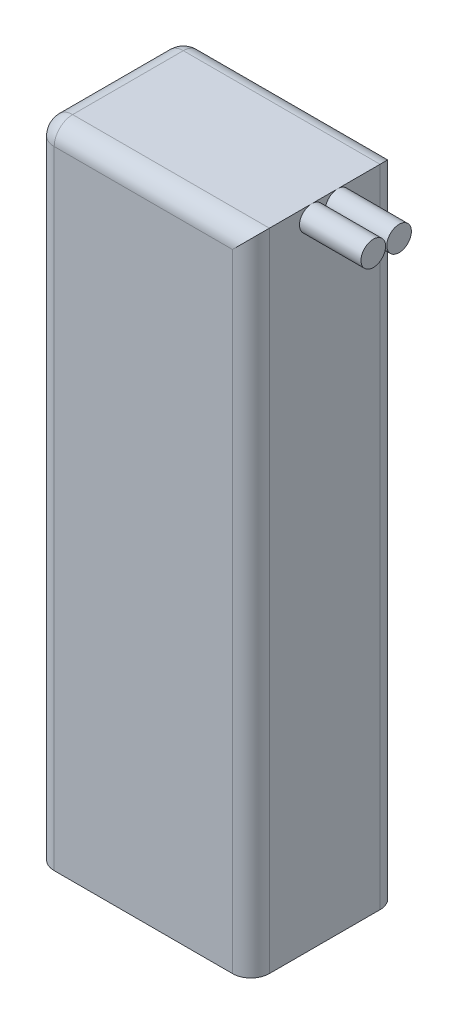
ISO-10303-21;
HEADER;
FILE_DESCRIPTION(('STEP AP214'),'2;1');
FILE_NAME('part.step','',(''),(''),'','','');
FILE_SCHEMA(('AUTOMOTIVE_DESIGN { 1 0 10303 214 1 1 1 1 }'));
ENDSEC;
DATA;
#1=APPLICATION_CONTEXT('core data for automotive mechanical design processes');
#2=APPLICATION_PROTOCOL_DEFINITION('international standard','automotive_design',2000,#1);
#3=PRODUCT_CONTEXT('',#1,'mechanical');
#4=PRODUCT('Part','Part','',(#3));
#5=PRODUCT_RELATED_PRODUCT_CATEGORY('part','',(#4));
#6=PRODUCT_DEFINITION_FORMATION('','',#4);
#7=PRODUCT_DEFINITION_CONTEXT('part definition',#1,'design');
#8=PRODUCT_DEFINITION('design','',#6,#7);
#9=PRODUCT_DEFINITION_SHAPE('','',#8);
#10=(LENGTH_UNIT() NAMED_UNIT(*) SI_UNIT(.MILLI.,.METRE.));
#11=(NAMED_UNIT(*) PLANE_ANGLE_UNIT() SI_UNIT($,.RADIAN.));
#12=(NAMED_UNIT(*) SI_UNIT($,.STERADIAN.) SOLID_ANGLE_UNIT());
#13=UNCERTAINTY_MEASURE_WITH_UNIT(LENGTH_MEASURE(1.E-05),#10,'distance_accuracy_value','');
#14=(GEOMETRIC_REPRESENTATION_CONTEXT(3) GLOBAL_UNCERTAINTY_ASSIGNED_CONTEXT((#13)) GLOBAL_UNIT_ASSIGNED_CONTEXT((#10,
#11,#12)) REPRESENTATION_CONTEXT('',''));
#15=CARTESIAN_POINT('',(0.,0.,0.));
#16=DIRECTION('',(0.,0.,1.));
#17=DIRECTION('',(1.,0.,0.));
#18=AXIS2_PLACEMENT_3D('',#15,#16,#17);
#19=CARTESIAN_POINT('',(0.,105.,0.));
#20=DIRECTION('',(1.,0.,0.));
#21=DIRECTION('',(0.,0.,-1.));
#22=AXIS2_PLACEMENT_3D('',#19,#20,#21);
#23=PLANE('',#22);
#24=DIRECTION('',(0.,0.,1.));
#25=VECTOR('',#24,1.);
#26=CARTESIAN_POINT('',(0.,102.,0.));
#27=LINE('',#26,#25);
#28=CARTESIAN_POINT('',(0.,102.,-3.));
#29=VERTEX_POINT('',#28);
#30=CARTESIAN_POINT('',(0.,102.,-21.));
#31=VERTEX_POINT('',#30);
#32=EDGE_CURVE('E171',#29,#31,#27,.F.);
#33=ORIENTED_EDGE('',*,*,#32,.T.);
#34=DIRECTION('',(0.,-1.,0.));
#35=VECTOR('',#34,1.);
#36=CARTESIAN_POINT('',(0.,105.,-21.));
#37=LINE('',#36,#35);
#38=CARTESIAN_POINT('',(0.,0.,-21.));
#39=VERTEX_POINT('',#38);
#40=EDGE_CURVE('E174',#31,#39,#37,.T.);
#41=ORIENTED_EDGE('',*,*,#40,.T.);
#42=DIRECTION('',(0.,0.,1.));
#43=VECTOR('',#42,1.);
#44=CARTESIAN_POINT('',(0.,0.,0.));
#45=LINE('',#44,#43);
#46=CARTESIAN_POINT('',(0.,0.,-3.));
#47=VERTEX_POINT('',#46);
#48=EDGE_CURVE('E251',#39,#47,#45,.T.);
#49=ORIENTED_EDGE('',*,*,#48,.T.);
#50=DIRECTION('',(0.,-1.,0.));
#51=VECTOR('',#50,1.);
#52=CARTESIAN_POINT('',(0.,105.,-3.));
#53=LINE('',#52,#51);
#54=EDGE_CURVE('E168',#47,#29,#53,.F.);
#55=ORIENTED_EDGE('',*,*,#54,.T.);
#56=EDGE_LOOP('',(#33,#41,#49,#55));
#57=FACE_BOUND('',#56,.T.);
#58=ADVANCED_FACE('F50',(#57),#23,.F.);
#59=CARTESIAN_POINT('',(0.,105.,0.));
#60=DIRECTION('',(0.,0.,-1.));
#61=DIRECTION('',(-1.,0.,0.));
#62=AXIS2_PLACEMENT_3D('',#59,#60,#61);
#63=PLANE('',#62);
#64=DIRECTION('',(1.,0.,0.));
#65=VECTOR('',#64,1.);
#66=CARTESIAN_POINT('',(0.,102.,0.));
#67=LINE('',#66,#65);
#68=CARTESIAN_POINT('',(32.,102.,0.));
#69=VERTEX_POINT('',#68);
#70=CARTESIAN_POINT('',(3.,102.,0.));
#71=VERTEX_POINT('',#70);
#72=EDGE_CURVE('E67',#69,#71,#67,.F.);
#73=ORIENTED_EDGE('',*,*,#72,.T.);
#74=DIRECTION('',(0.,-1.,0.));
#75=VECTOR('',#74,1.);
#76=CARTESIAN_POINT('',(3.,105.,0.));
#77=LINE('',#76,#75);
#78=CARTESIAN_POINT('',(3.,0.,0.));
#79=VERTEX_POINT('',#78);
#80=EDGE_CURVE('E11',#71,#79,#77,.T.);
#81=ORIENTED_EDGE('',*,*,#80,.T.);
#82=DIRECTION('',(1.,0.,0.));
#83=VECTOR('',#82,1.);
#84=CARTESIAN_POINT('',(0.,0.,0.));
#85=LINE('',#84,#83);
#86=CARTESIAN_POINT('',(32.,0.,0.));
#87=VERTEX_POINT('',#86);
#88=EDGE_CURVE('E265',#79,#87,#85,.T.);
#89=ORIENTED_EDGE('',*,*,#88,.T.);
#90=DIRECTION('',(0.,-1.,0.));
#91=VECTOR('',#90,1.);
#92=CARTESIAN_POINT('',(32.,105.,0.));
#93=LINE('',#92,#91);
#94=EDGE_CURVE('E60',#87,#69,#93,.F.);
#95=ORIENTED_EDGE('',*,*,#94,.T.);
#96=EDGE_LOOP('',(#73,#81,#89,#95));
#97=FACE_BOUND('',#96,.T.);
#98=ADVANCED_FACE('F267',(#97),#63,.F.);
#99=CARTESIAN_POINT('',(35.,105.,0.));
#100=DIRECTION('',(-1.,0.,0.));
#101=DIRECTION('',(0.,0.,1.));
#102=AXIS2_PLACEMENT_3D('',#99,#100,#101);
#103=PLANE('',#102);
#104=DIRECTION('',(0.,0.,-1.));
#105=VECTOR('',#104,1.);
#106=CARTESIAN_POINT('',(35.,0.,0.));
#107=LINE('',#106,#105);
#108=CARTESIAN_POINT('',(35.,0.,-3.));
#109=VERTEX_POINT('',#108);
#110=CARTESIAN_POINT('',(35.,0.,-21.));
#111=VERTEX_POINT('',#110);
#112=EDGE_CURVE('E150',#109,#111,#107,.T.);
#113=ORIENTED_EDGE('',*,*,#112,.T.);
#114=DIRECTION('',(0.,-1.,0.));
#115=VECTOR('',#114,1.);
#116=CARTESIAN_POINT('',(35.,105.,-21.));
#117=LINE('',#116,#115);
#118=CARTESIAN_POINT('',(35.,105.,-21.));
#119=VERTEX_POINT('',#118);
#120=EDGE_CURVE('E145',#111,#119,#117,.F.);
#121=ORIENTED_EDGE('',*,*,#120,.T.);
#122=DIRECTION('',(0.,0.,-1.));
#123=VECTOR('',#122,1.);
#124=CARTESIAN_POINT('',(35.,105.,0.));
#125=LINE('',#124,#123);
#126=CARTESIAN_POINT('',(35.,105.,-14.1));
#127=VERTEX_POINT('',#126);
#128=EDGE_CURVE('E131',#127,#119,#125,.T.);
#129=ORIENTED_EDGE('',*,*,#128,.F.);
#130=CARTESIAN_POINT('',(35.,103.,-14.1));
#131=DIRECTION('',(1.,0.,0.));
#132=DIRECTION('',(0.,0.,-1.));
#133=AXIS2_PLACEMENT_3D('',#130,#131,#132);
#134=CIRCLE('',#133,2.00000000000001);
#135=EDGE_CURVE('E143',#127,#127,#134,.T.);
#136=ORIENTED_EDGE('',*,*,#135,.F.);
#137=CARTESIAN_POINT('',(35.,105.,-9.9));
#138=VERTEX_POINT('',#137);
#139=EDGE_CURVE('E128',#138,#127,#125,.T.);
#140=ORIENTED_EDGE('',*,*,#139,.F.);
#141=CARTESIAN_POINT('',(35.,103.,-9.9));
#142=DIRECTION('',(1.,0.,0.));
#143=DIRECTION('',(0.,0.,-1.));
#144=AXIS2_PLACEMENT_3D('',#141,#142,#143);
#145=CIRCLE('',#144,2.);
#146=EDGE_CURVE('E245',#138,#138,#145,.T.);
#147=ORIENTED_EDGE('',*,*,#146,.F.);
#148=CARTESIAN_POINT('',(35.,105.,-3.));
#149=VERTEX_POINT('',#148);
#150=EDGE_CURVE('E134',#149,#138,#125,.T.);
#151=ORIENTED_EDGE('',*,*,#150,.F.);
#152=DIRECTION('',(0.,-1.,0.));
#153=VECTOR('',#152,1.);
#154=CARTESIAN_POINT('',(35.,105.,-3.));
#155=LINE('',#154,#153);
#156=EDGE_CURVE('E198',#149,#109,#155,.T.);
#157=ORIENTED_EDGE('',*,*,#156,.T.);
#158=EDGE_LOOP('',(#113,#121,#129,#136,#140,#147,#151,#157));
#159=FACE_BOUND('',#158,.T.);
#160=ADVANCED_FACE('F141',(#159),#103,.F.);
#161=CARTESIAN_POINT('',(0.,105.,-24.));
#162=DIRECTION('',(0.,0.,1.));
#163=DIRECTION('',(1.,0.,0.));
#164=AXIS2_PLACEMENT_3D('',#161,#162,#163);
#165=PLANE('',#164);
#166=DIRECTION('',(-1.,0.,0.));
#167=VECTOR('',#166,1.);
#168=CARTESIAN_POINT('',(0.,0.,-24.));
#169=LINE('',#168,#167);
#170=CARTESIAN_POINT('',(32.,0.,-24.));
#171=VERTEX_POINT('',#170);
#172=CARTESIAN_POINT('',(2.99999999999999,0.,-24.));
#173=VERTEX_POINT('',#172);
#174=EDGE_CURVE('E147',#171,#173,#169,.T.);
#175=ORIENTED_EDGE('',*,*,#174,.T.);
#176=DIRECTION('',(0.,-1.,0.));
#177=VECTOR('',#176,1.);
#178=CARTESIAN_POINT('',(2.99999999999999,105.,-24.));
#179=LINE('',#178,#177);
#180=CARTESIAN_POINT('',(2.99999999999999,102.,-24.));
#181=VERTEX_POINT('',#180);
#182=EDGE_CURVE('E183',#173,#181,#179,.F.);
#183=ORIENTED_EDGE('',*,*,#182,.T.);
#184=DIRECTION('',(-1.,0.,0.));
#185=VECTOR('',#184,1.);
#186=CARTESIAN_POINT('',(0.,102.,-24.));
#187=LINE('',#186,#185);
#188=CARTESIAN_POINT('',(32.,102.,-24.));
#189=VERTEX_POINT('',#188);
#190=EDGE_CURVE('E180',#181,#189,#187,.F.);
#191=ORIENTED_EDGE('',*,*,#190,.T.);
#192=DIRECTION('',(0.,-1.,0.));
#193=VECTOR('',#192,1.);
#194=CARTESIAN_POINT('',(32.,105.,-24.));
#195=LINE('',#194,#193);
#196=EDGE_CURVE('E177',#189,#171,#195,.T.);
#197=ORIENTED_EDGE('',*,*,#196,.T.);
#198=EDGE_LOOP('',(#175,#183,#191,#197));
#199=FACE_BOUND('',#198,.T.);
#200=ADVANCED_FACE('F301',(#199),#165,.F.);
#201=CARTESIAN_POINT('',(0.,105.,0.));
#202=DIRECTION('',(0.,-1.,0.));
#203=DIRECTION('',(0.,0.,-1.));
#204=AXIS2_PLACEMENT_3D('',#201,#202,#203);
#205=PLANE('',#204);
#206=ORIENTED_EDGE('',*,*,#128,.T.);
#207=DIRECTION('',(-1.,0.,0.));
#208=VECTOR('',#207,1.);
#209=CARTESIAN_POINT('',(0.,105.,-21.));
#210=LINE('',#209,#208);
#211=CARTESIAN_POINT('',(2.99999999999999,105.,-21.));
#212=VERTEX_POINT('',#211);
#213=EDGE_CURVE('E162',#119,#212,#210,.T.);
#214=ORIENTED_EDGE('',*,*,#213,.T.);
#215=DIRECTION('',(0.,0.,1.));
#216=VECTOR('',#215,1.);
#217=CARTESIAN_POINT('',(3.,105.,0.));
#218=LINE('',#217,#216);
#219=CARTESIAN_POINT('',(3.,105.,-3.));
#220=VERTEX_POINT('',#219);
#221=EDGE_CURVE('E157',#212,#220,#218,.T.);
#222=ORIENTED_EDGE('',*,*,#221,.T.);
#223=DIRECTION('',(1.,0.,0.));
#224=VECTOR('',#223,1.);
#225=CARTESIAN_POINT('',(0.,105.,-3.));
#226=LINE('',#225,#224);
#227=EDGE_CURVE('E155',#220,#149,#226,.T.);
#228=ORIENTED_EDGE('',*,*,#227,.T.);
#229=ORIENTED_EDGE('',*,*,#150,.T.);
#230=ORIENTED_EDGE('',*,*,#139,.T.);
#231=EDGE_LOOP('',(#206,#214,#222,#228,#229,#230));
#232=FACE_BOUND('',#231,.T.);
#233=ADVANCED_FACE('F130',(#232),#205,.F.);
#234=CARTESIAN_POINT('',(0.,0.,0.));
#235=DIRECTION('',(0.,-1.,0.));
#236=DIRECTION('',(0.,0.,-1.));
#237=AXIS2_PLACEMENT_3D('',#234,#235,#236);
#238=PLANE('',#237);
#239=ORIENTED_EDGE('',*,*,#48,.F.);
#240=CARTESIAN_POINT('',(2.99999999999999,0.,-21.));
#241=DIRECTION('',(0.,-1.,0.));
#242=DIRECTION('',(0.,0.,-1.));
#243=AXIS2_PLACEMENT_3D('',#240,#241,#242);
#244=CIRCLE('',#243,3.);
#245=EDGE_CURVE('E195',#39,#173,#244,.T.);
#246=ORIENTED_EDGE('',*,*,#245,.T.);
#247=ORIENTED_EDGE('',*,*,#174,.F.);
#248=CARTESIAN_POINT('',(32.,0.,-21.));
#249=DIRECTION('',(0.,-1.,0.));
#250=DIRECTION('',(0.,0.,-1.));
#251=AXIS2_PLACEMENT_3D('',#248,#249,#250);
#252=CIRCLE('',#251,3.);
#253=EDGE_CURVE('E192',#171,#111,#252,.T.);
#254=ORIENTED_EDGE('',*,*,#253,.T.);
#255=ORIENTED_EDGE('',*,*,#112,.F.);
#256=CARTESIAN_POINT('',(32.,0.,-3.));
#257=DIRECTION('',(0.,-1.,0.));
#258=DIRECTION('',(0.,0.,-1.));
#259=AXIS2_PLACEMENT_3D('',#256,#257,#258);
#260=CIRCLE('',#259,3.);
#261=EDGE_CURVE('E186',#109,#87,#260,.T.);
#262=ORIENTED_EDGE('',*,*,#261,.T.);
#263=ORIENTED_EDGE('',*,*,#88,.F.);
#264=CARTESIAN_POINT('',(3.,0.,-3.));
#265=DIRECTION('',(0.,-1.,0.));
#266=DIRECTION('',(0.,0.,-1.));
#267=AXIS2_PLACEMENT_3D('',#264,#265,#266);
#268=CIRCLE('',#267,3.);
#269=EDGE_CURVE('E189',#79,#47,#268,.T.);
#270=ORIENTED_EDGE('',*,*,#269,.T.);
#271=EDGE_LOOP('',(#239,#246,#247,#254,#255,#262,#263,#270));
#272=FACE_BOUND('',#271,.T.);
#273=ADVANCED_FACE('F264',(#272),#238,.T.);
#274=CARTESIAN_POINT('',(45.,103.,-9.90000000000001));
#275=DIRECTION('',(-1.,0.,0.));
#276=DIRECTION('',(0.,0.,1.));
#277=AXIS2_PLACEMENT_3D('',#274,#275,#276);
#278=CYLINDRICAL_SURFACE('',#277,2.);
#279=CARTESIAN_POINT('',(45.,103.,-9.90000000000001));
#280=DIRECTION('',(1.,0.,0.));
#281=DIRECTION('',(0.,0.,-1.));
#282=AXIS2_PLACEMENT_3D('',#279,#280,#281);
#283=CIRCLE('',#282,2.);
#284=CARTESIAN_POINT('',(45.,103.,-11.9));
#285=VERTEX_POINT('',#284);
#286=EDGE_CURVE('E248',#285,#285,#283,.T.);
#287=ORIENTED_EDGE('',*,*,#286,.F.);
#288=EDGE_LOOP('',(#287));
#289=FACE_BOUND('',#288,.T.);
#290=ORIENTED_EDGE('',*,*,#146,.T.);
#291=EDGE_LOOP('',(#290));
#292=FACE_BOUND('',#291,.T.);
#293=ADVANCED_FACE('F255',(#289,#292),#278,.T.);
#294=CARTESIAN_POINT('',(45.,103.,-9.90000000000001));
#295=DIRECTION('',(1.,0.,0.));
#296=DIRECTION('',(0.,0.,-1.));
#297=AXIS2_PLACEMENT_3D('',#294,#295,#296);
#298=PLANE('',#297);
#299=ORIENTED_EDGE('',*,*,#286,.T.);
#300=EDGE_LOOP('',(#299));
#301=FACE_BOUND('',#300,.T.);
#302=ADVANCED_FACE('F397',(#301),#298,.T.);
#303=CARTESIAN_POINT('',(45.,103.,-14.1));
#304=DIRECTION('',(-1.,0.,0.));
#305=DIRECTION('',(0.,0.,1.));
#306=AXIS2_PLACEMENT_3D('',#303,#304,#305);
#307=CYLINDRICAL_SURFACE('',#306,2.00000000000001);
#308=CARTESIAN_POINT('',(45.,103.,-14.1));
#309=DIRECTION('',(1.,0.,0.));
#310=DIRECTION('',(0.,0.,-1.));
#311=AXIS2_PLACEMENT_3D('',#308,#309,#310);
#312=CIRCLE('',#311,2.00000000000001);
#313=CARTESIAN_POINT('',(45.,103.,-16.1));
#314=VERTEX_POINT('',#313);
#315=EDGE_CURVE('E235',#314,#314,#312,.T.);
#316=ORIENTED_EDGE('',*,*,#315,.F.);
#317=EDGE_LOOP('',(#316));
#318=FACE_BOUND('',#317,.T.);
#319=ORIENTED_EDGE('',*,*,#135,.T.);
#320=EDGE_LOOP('',(#319));
#321=FACE_BOUND('',#320,.T.);
#322=ADVANCED_FACE('F311',(#318,#321),#307,.T.);
#323=CARTESIAN_POINT('',(45.,103.,-14.1));
#324=DIRECTION('',(1.,0.,0.));
#325=DIRECTION('',(0.,0.,-1.));
#326=AXIS2_PLACEMENT_3D('',#323,#324,#325);
#327=PLANE('',#326);
#328=ORIENTED_EDGE('',*,*,#315,.T.);
#329=EDGE_LOOP('',(#328));
#330=FACE_BOUND('',#329,.T.);
#331=ADVANCED_FACE('F305',(#330),#327,.T.);
#332=CARTESIAN_POINT('',(32.,105.,-21.));
#333=DIRECTION('',(0.,-1.,0.));
#334=DIRECTION('',(0.,0.,-1.));
#335=AXIS2_PLACEMENT_3D('',#332,#333,#334);
#336=CYLINDRICAL_SURFACE('',#335,3.);
#337=ORIENTED_EDGE('',*,*,#253,.F.);
#338=ORIENTED_EDGE('',*,*,#196,.F.);
#339=CARTESIAN_POINT('',(32.,102.,-21.));
#340=DIRECTION('',(0.707106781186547,-0.707106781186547,0.));
#341=DIRECTION('',(-0.707106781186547,-0.707106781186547,0.));
#342=AXIS2_PLACEMENT_3D('',#339,#340,#341);
#343=ELLIPSE('',#342,4.24264068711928,3.);
#344=EDGE_CURVE('E54',#119,#189,#343,.F.);
#345=ORIENTED_EDGE('',*,*,#344,.F.);
#346=ORIENTED_EDGE('',*,*,#120,.F.);
#347=EDGE_LOOP('',(#337,#338,#345,#346));
#348=FACE_BOUND('',#347,.T.);
#349=ADVANCED_FACE('F52',(#348),#336,.T.);
#350=CARTESIAN_POINT('',(32.,105.,-3.));
#351=DIRECTION('',(0.,-1.,0.));
#352=DIRECTION('',(0.,0.,-1.));
#353=AXIS2_PLACEMENT_3D('',#350,#351,#352);
#354=CYLINDRICAL_SURFACE('',#353,3.);
#355=ORIENTED_EDGE('',*,*,#261,.F.);
#356=ORIENTED_EDGE('',*,*,#156,.F.);
#357=CARTESIAN_POINT('',(32.,102.,-3.));
#358=DIRECTION('',(0.707106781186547,-0.707106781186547,0.));
#359=DIRECTION('',(0.707106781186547,0.707106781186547,0.));
#360=AXIS2_PLACEMENT_3D('',#357,#358,#359);
#361=ELLIPSE('',#360,4.24264068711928,3.);
#362=EDGE_CURVE('E229',#69,#149,#361,.F.);
#363=ORIENTED_EDGE('',*,*,#362,.F.);
#364=ORIENTED_EDGE('',*,*,#94,.F.);
#365=EDGE_LOOP('',(#355,#356,#363,#364));
#366=FACE_BOUND('',#365,.T.);
#367=ADVANCED_FACE('F260',(#366),#354,.T.);
#368=CARTESIAN_POINT('',(2.99999999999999,105.,-21.));
#369=DIRECTION('',(0.,-1.,0.));
#370=DIRECTION('',(0.,0.,-1.));
#371=AXIS2_PLACEMENT_3D('',#368,#369,#370);
#372=CYLINDRICAL_SURFACE('',#371,3.);
#373=ORIENTED_EDGE('',*,*,#245,.F.);
#374=ORIENTED_EDGE('',*,*,#40,.F.);
#375=CARTESIAN_POINT('',(2.99999999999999,102.,-21.));
#376=DIRECTION('',(0.,1.,0.));
#377=DIRECTION('',(0.,0.,1.));
#378=AXIS2_PLACEMENT_3D('',#375,#376,#377);
#379=CIRCLE('',#378,3.);
#380=EDGE_CURVE('E226',#181,#31,#379,.T.);
#381=ORIENTED_EDGE('',*,*,#380,.F.);
#382=ORIENTED_EDGE('',*,*,#182,.F.);
#383=EDGE_LOOP('',(#373,#374,#381,#382));
#384=FACE_BOUND('',#383,.T.);
#385=ADVANCED_FACE('F297',(#384),#372,.T.);
#386=CARTESIAN_POINT('',(0.,102.,-21.));
#387=DIRECTION('',(-1.,0.,0.));
#388=DIRECTION('',(0.,0.,1.));
#389=AXIS2_PLACEMENT_3D('',#386,#387,#388);
#390=CYLINDRICAL_SURFACE('',#389,3.);
#391=ORIENTED_EDGE('',*,*,#344,.T.);
#392=ORIENTED_EDGE('',*,*,#190,.F.);
#393=CARTESIAN_POINT('',(2.99999999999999,102.,-21.));
#394=DIRECTION('',(-1.,0.,0.));
#395=DIRECTION('',(0.,0.,1.));
#396=AXIS2_PLACEMENT_3D('',#393,#394,#395);
#397=CIRCLE('',#396,3.);
#398=EDGE_CURVE('E222',#212,#181,#397,.T.);
#399=ORIENTED_EDGE('',*,*,#398,.F.);
#400=ORIENTED_EDGE('',*,*,#213,.F.);
#401=EDGE_LOOP('',(#391,#392,#399,#400));
#402=FACE_BOUND('',#401,.T.);
#403=ADVANCED_FACE('F291',(#402),#390,.T.);
#404=CARTESIAN_POINT('',(0.,102.,-3.));
#405=DIRECTION('',(1.,0.,0.));
#406=DIRECTION('',(0.,0.,-1.));
#407=AXIS2_PLACEMENT_3D('',#404,#405,#406);
#408=CYLINDRICAL_SURFACE('',#407,3.);
#409=ORIENTED_EDGE('',*,*,#362,.T.);
#410=ORIENTED_EDGE('',*,*,#227,.F.);
#411=CARTESIAN_POINT('',(3.,102.,-3.));
#412=DIRECTION('',(-1.,0.,0.));
#413=DIRECTION('',(0.,0.,1.));
#414=AXIS2_PLACEMENT_3D('',#411,#412,#413);
#415=CIRCLE('',#414,3.);
#416=EDGE_CURVE('E218',#71,#220,#415,.T.);
#417=ORIENTED_EDGE('',*,*,#416,.F.);
#418=ORIENTED_EDGE('',*,*,#72,.F.);
#419=EDGE_LOOP('',(#409,#410,#417,#418));
#420=FACE_BOUND('',#419,.T.);
#421=ADVANCED_FACE('F289',(#420),#408,.T.);
#422=CARTESIAN_POINT('',(3.,105.,-3.));
#423=DIRECTION('',(0.,-1.,0.));
#424=DIRECTION('',(0.,0.,-1.));
#425=AXIS2_PLACEMENT_3D('',#422,#423,#424);
#426=CYLINDRICAL_SURFACE('',#425,3.);
#427=ORIENTED_EDGE('',*,*,#269,.F.);
#428=ORIENTED_EDGE('',*,*,#80,.F.);
#429=CARTESIAN_POINT('',(3.,102.,-3.));
#430=DIRECTION('',(0.,1.,0.));
#431=DIRECTION('',(0.,0.,1.));
#432=AXIS2_PLACEMENT_3D('',#429,#430,#431);
#433=CIRCLE('',#432,3.);
#434=EDGE_CURVE('E214',#29,#71,#433,.T.);
#435=ORIENTED_EDGE('',*,*,#434,.F.);
#436=ORIENTED_EDGE('',*,*,#54,.F.);
#437=EDGE_LOOP('',(#427,#428,#435,#436));
#438=FACE_BOUND('',#437,.T.);
#439=ADVANCED_FACE('F279',(#438),#426,.T.);
#440=CARTESIAN_POINT('',(2.99999999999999,102.,-21.));
#441=DIRECTION('',(0.,0.,-1.));
#442=DIRECTION('',(-1.,0.,0.));
#443=AXIS2_PLACEMENT_3D('',#440,#441,#442);
#444=SPHERICAL_SURFACE('',#443,3.);
#445=ORIENTED_EDGE('',*,*,#398,.T.);
#446=ORIENTED_EDGE('',*,*,#380,.T.);
#447=CARTESIAN_POINT('',(2.99999999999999,102.,-21.));
#448=DIRECTION('',(0.,0.,-1.));
#449=DIRECTION('',(0.,1.,0.));
#450=AXIS2_PLACEMENT_3D('',#447,#448,#449);
#451=CIRCLE('',#450,3.);
#452=EDGE_CURVE('E210',#212,#31,#451,.F.);
#453=ORIENTED_EDGE('',*,*,#452,.F.);
#454=EDGE_LOOP('',(#445,#446,#453));
#455=FACE_BOUND('',#454,.T.);
#456=ADVANCED_FACE('F294',(#455),#444,.T.);
#457=CARTESIAN_POINT('',(3.,102.,-3.));
#458=DIRECTION('',(0.,0.,1.));
#459=DIRECTION('',(1.,0.,0.));
#460=AXIS2_PLACEMENT_3D('',#457,#458,#459);
#461=SPHERICAL_SURFACE('',#460,3.);
#462=ORIENTED_EDGE('',*,*,#434,.T.);
#463=ORIENTED_EDGE('',*,*,#416,.T.);
#464=CARTESIAN_POINT('',(3.,102.,-3.));
#465=DIRECTION('',(0.,0.,1.));
#466=DIRECTION('',(1.,0.,0.));
#467=AXIS2_PLACEMENT_3D('',#464,#465,#466);
#468=CIRCLE('',#467,3.);
#469=EDGE_CURVE('E207',#29,#220,#468,.F.);
#470=ORIENTED_EDGE('',*,*,#469,.F.);
#471=EDGE_LOOP('',(#462,#463,#470));
#472=FACE_BOUND('',#471,.T.);
#473=ADVANCED_FACE('F288',(#472),#461,.T.);
#474=CARTESIAN_POINT('',(3.,102.,0.));
#475=DIRECTION('',(0.,0.,1.));
#476=DIRECTION('',(1.,0.,0.));
#477=AXIS2_PLACEMENT_3D('',#474,#475,#476);
#478=CYLINDRICAL_SURFACE('',#477,3.);
#479=ORIENTED_EDGE('',*,*,#452,.T.);
#480=ORIENTED_EDGE('',*,*,#32,.F.);
#481=ORIENTED_EDGE('',*,*,#469,.T.);
#482=ORIENTED_EDGE('',*,*,#221,.F.);
#483=EDGE_LOOP('',(#479,#480,#481,#482));
#484=FACE_BOUND('',#483,.T.);
#485=ADVANCED_FACE('F285',(#484),#478,.T.);
#486=CLOSED_SHELL('',(#58,#98,#160,#200,#233,#273,#293,#302,#322,#331,#349,#367,#385,#403,#421,
#439,#456,#473,#485));
#487=MANIFOLD_SOLID_BREP('B2',#486);
#488=ADVANCED_BREP_SHAPE_REPRESENTATION('',(#18,#487),#14);
#489=SHAPE_DEFINITION_REPRESENTATION(#9,#488);
ENDSEC;
END-ISO-10303-21;
